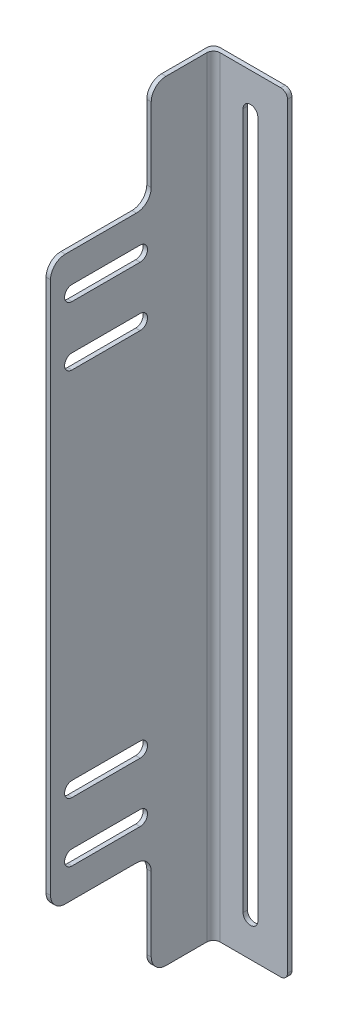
from build123d import *

# Parameters (mm, degrees)
ESQUISSE1_W      = 50
ESQUISSE1_H      = 520
EXTRUSION1_DEPTH = 3
ESQUISSE2_W      = 110
ESQUISSE2_H      = 520
ESQUISSE2_W_2    = 3
EXTRUSION2_DEPTH = 3
CONG_1_R         = 4.5
EXTRUSION3_REACH = 512.493
EXTRUSION4_DEPTH = 10
CONG_2_R         = 10
CONG_3_R         = 10


with BuildPart() as part:
    # Esquisse1 → Extrusion1 (new body)
    with BuildSketch(Plane.XY):
        with Locations((0, 235)):
            Rectangle(ESQUISSE1_W, ESQUISSE1_H)
        with BuildLine():
            Line((-5, 0), (-5, 470))
            ThreePointArc((-5, 470), (0, 475), (5, 470))
            Line((5, 470), (5, 0))
            ThreePointArc((5, 0), (0, -5), (-5, 0))
        make_face(mode=Mode.SUBTRACT)
    extrude(amount=EXTRUSION1_DEPTH)

    # Esquisse2 → Extrusion2 (add)
    # profile 1 of 2: a face of its own
    with BuildSketch(Plane.ZY.offset(25)):
        with Locations((58, 235)):
            Rectangle(ESQUISSE2_W, ESQUISSE2_H)
        with BuildLine():
            ThreePointArc((98.5, 75), (103.5, 70), (98.5, 65))
            Line((98.5, 65), (52.5, 65))
            ThreePointArc((52.5, 65), (47.5, 70), (52.5, 75))
            Line((52.5, 75), (98.5, 75))
        make_face(mode=Mode.SUBTRACT)
        with BuildLine():
            ThreePointArc((52.5, 105), (47.5, 110), (52.5, 115))
            Line((52.5, 115), (98.5, 115))
            ThreePointArc((98.5, 115), (103.5, 110), (98.5, 105))
            Line((98.5, 105), (52.5, 105))
        make_face(mode=Mode.SUBTRACT)
        with BuildLine():
            ThreePointArc((52.5, 355), (47.5, 360), (52.5, 365))
            Line((52.5, 365), (98.5, 365))
            ThreePointArc((98.5, 365), (103.5, 360), (98.5, 355))
            Line((98.5, 355), (52.5, 355))
        make_face(mode=Mode.SUBTRACT)
        with BuildLine():
            ThreePointArc((98.5, 405), (103.5, 400), (98.5, 395))
            Line((98.5, 395), (52.5, 395))
            ThreePointArc((52.5, 395), (47.5, 400), (52.5, 405))
            Line((52.5, 405), (98.5, 405))
        make_face(mode=Mode.SUBTRACT)
    # profile 2 of 2: a face of its own
    with BuildSketch(Plane.ZY.offset(25)):
        with Locations((1.5, 235)):
            Rectangle(ESQUISSE2_W_2, ESQUISSE2_H)
    extrude(amount=EXTRUSION2_DEPTH)

    # Cong_1
    cong_1_edges = [part.edges().sort_by_distance(p)[0] for p in [
        (-26.5, -25, 113),
        (-26.5, 495, 113),
        (25, 495, 1.5),
        (25, -25, 1.5),
        (-25, 235, 3),
        (-28, 235, 0),
    ]]
    fillet(cong_1_edges, radius=CONG_1_R)

    # Esquisse4 → Extrusion3 (cut, up to next)
    with BuildSketch(Plane.ZY.offset(28), mode=Mode.PRIVATE) as extrusion3_sk1:
        with BuildLine():
            Line((45, 495), (113, 425))
            Line((113, 425), (113, 490.5))
            ThreePointArc((113, 490.5), (111.681980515, 493.681980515), (108.5, 495))
            Line((108.5, 495), (45, 495))
        make_face()
    extrusion3_tool1 = extrude(extrusion3_sk1.sketch, amount=-EXTRUSION3_REACH, mode=Mode.PRIVATE) & part.part
    # Esquisse4 → Extrusion3 (cut, up to next)
    with BuildSketch(Plane.ZY.offset(28), mode=Mode.PRIVATE) as extrusion3_sk2:
        with BuildLine():
            Line((113, -20.5), (113, 45))
            Line((113, 45), (45, -25))
            Line((45, -25), (108.5, -25))
            ThreePointArc((108.5, -25), (111.681980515, -23.681980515), (113, -20.5))
        make_face()
    extrusion3_tool2 = extrude(extrusion3_sk2.sketch, amount=-EXTRUSION3_REACH, mode=Mode.PRIVATE) & part.part
    add(extrusion3_tool1.solids().sort_by_distance((-28, 471.625823, 90.293709))[0], mode=Mode.SUBTRACT)
    add(extrusion3_tool2.solids().sort_by_distance((-28, -1.625823, 90.293709))[0], mode=Mode.SUBTRACT)

    # Esquisse4_3 → Extrusion4 (cut)
    with BuildSketch(Plane.ZY.offset(28)):
        Polygon((45, 495), (45, 425), (113, 425), align=None)
        Polygon((113, 45), (45, 45), (45, -25), align=None)
    extrude(amount=-EXTRUSION4_DEPTH, mode=Mode.SUBTRACT)

    # Cong_2
    cong_2_edges = [part.edges().sort_by_distance(p)[0] for p in [
        (-26.5, 495, 45),
        (-26.5, 425, 113),
        (-26.5, 45, 113),
        (-26.5, -25, 45),
    ]]
    fillet(cong_2_edges, radius=CONG_2_R)

    # Cong_3
    cong_3_edges = [part.edges().sort_by_distance(p)[0] for p in [
        (-26.5, 425, 45),
        (-26.5, 45, 45),
    ]]
    fillet(cong_3_edges, radius=CONG_3_R)


solid = part.part
